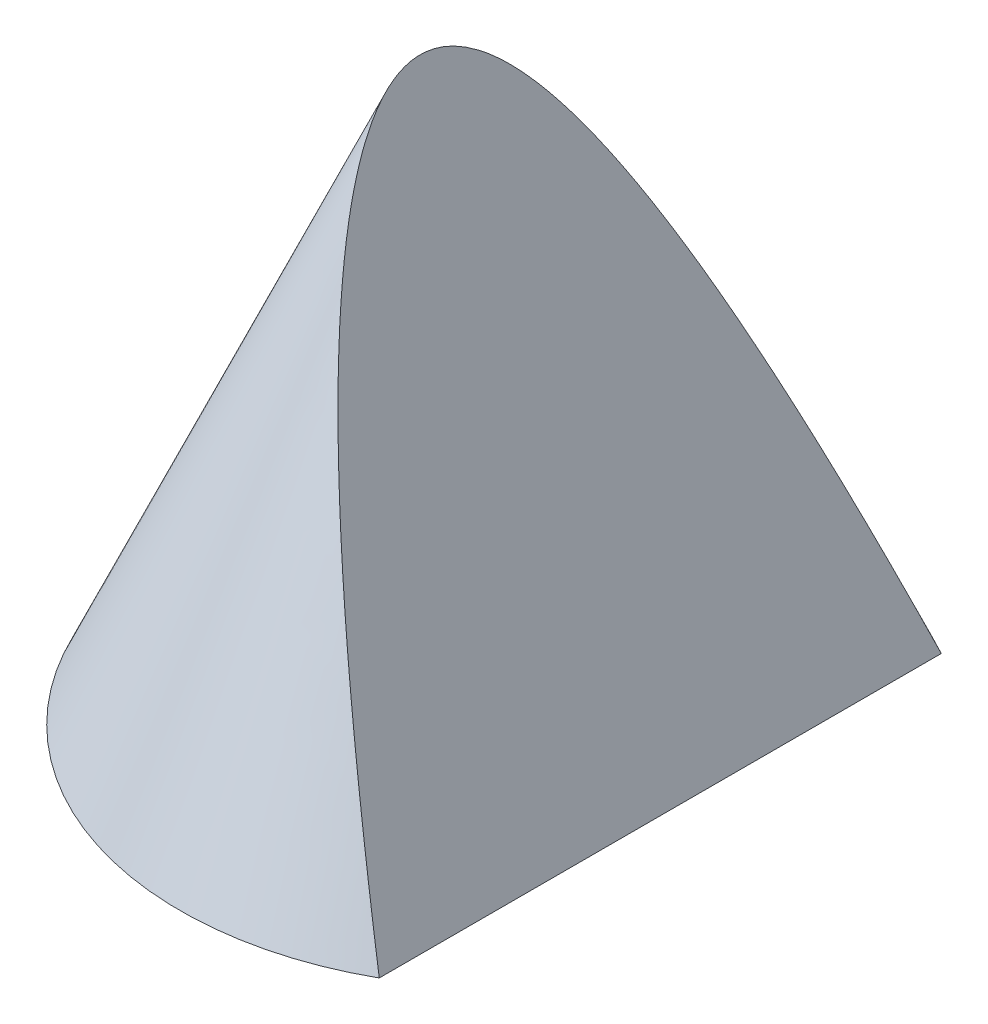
ISO-10303-21;
HEADER;
FILE_DESCRIPTION(('STEP AP214'),'2;1');
FILE_NAME('part.step','',(''),(''),'','','');
FILE_SCHEMA(('AUTOMOTIVE_DESIGN { 1 0 10303 214 1 1 1 1 }'));
ENDSEC;
DATA;
#1=APPLICATION_CONTEXT('core data for automotive mechanical design processes');
#2=APPLICATION_PROTOCOL_DEFINITION('international standard','automotive_design',2000,#1);
#3=PRODUCT_CONTEXT('',#1,'mechanical');
#4=PRODUCT('Part','Part','',(#3));
#5=PRODUCT_RELATED_PRODUCT_CATEGORY('part','',(#4));
#6=PRODUCT_DEFINITION_FORMATION('','',#4);
#7=PRODUCT_DEFINITION_CONTEXT('part definition',#1,'design');
#8=PRODUCT_DEFINITION('design','',#6,#7);
#9=PRODUCT_DEFINITION_SHAPE('','',#8);
#10=(LENGTH_UNIT() NAMED_UNIT(*) SI_UNIT(.MILLI.,.METRE.));
#11=(NAMED_UNIT(*) PLANE_ANGLE_UNIT() SI_UNIT($,.RADIAN.));
#12=(NAMED_UNIT(*) SI_UNIT($,.STERADIAN.) SOLID_ANGLE_UNIT());
#13=UNCERTAINTY_MEASURE_WITH_UNIT(LENGTH_MEASURE(1.E-05),#10,'distance_accuracy_value','');
#14=(GEOMETRIC_REPRESENTATION_CONTEXT(3) GLOBAL_UNCERTAINTY_ASSIGNED_CONTEXT((#13)) GLOBAL_UNIT_ASSIGNED_CONTEXT((#10,
#11,#12)) REPRESENTATION_CONTEXT('',''));
#15=CARTESIAN_POINT('',(0.,0.,0.));
#16=DIRECTION('',(0.,0.,1.));
#17=DIRECTION('',(1.,0.,0.));
#18=AXIS2_PLACEMENT_3D('',#15,#16,#17);
#19=CARTESIAN_POINT('',(0.,0.,0.));
#20=DIRECTION('',(0.,-1.,0.));
#21=DIRECTION('',(0.,0.,1.));
#22=AXIS2_PLACEMENT_3D('',#19,#20,#21);
#23=CONICAL_SURFACE('',#22,18.4677912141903,0.41887902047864);
#24=CARTESIAN_POINT('',(9.04129462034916,-0.000200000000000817,-16.1033410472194));
#25=CARTESIAN_POINT('',(8.83064351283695,0.47293013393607,-15.9800273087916));
#26=CARTESIAN_POINT('',(8.62012192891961,0.945769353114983,-15.8553787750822));
#27=CARTESIAN_POINT('',(8.19936127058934,1.89081326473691,-15.603217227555));
#28=CARTESIAN_POINT('',(7.98912219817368,2.363017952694,-15.475704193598));
#29=CARTESIAN_POINT('',(7.35880991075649,3.77872252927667,-15.0885427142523));
#30=CARTESIAN_POINT('',(6.93920027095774,4.72118121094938,-14.8243061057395));
#31=CARTESIAN_POINT('',(6.09916897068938,6.60792240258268,-14.2801830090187));
#32=CARTESIAN_POINT('',(5.67875573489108,7.55218599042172,-14.0002177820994));
#33=CARTESIAN_POINT('',(4.83985959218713,9.43637757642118,-13.4235051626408));
#34=CARTESIAN_POINT('',(4.42137654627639,10.3763058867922,-13.1267589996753));
#35=CARTESIAN_POINT('',(3.78383007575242,11.8082587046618,-12.6579563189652));
#36=CARTESIAN_POINT('',(3.56388146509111,12.3022713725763,-12.4931641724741));
#37=CARTESIAN_POINT('',(3.12477592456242,13.2885185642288,-12.157330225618));
#38=CARTESIAN_POINT('',(2.90561898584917,13.780753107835,-11.9862884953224));
#39=CARTESIAN_POINT('',(2.46817559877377,14.7632670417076,-11.6371787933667));
#40=CARTESIAN_POINT('',(2.24988936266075,15.2535459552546,-11.4591092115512));
#41=CARTESIAN_POINT('',(1.81440663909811,16.2316561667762,-11.0950878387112));
#42=CARTESIAN_POINT('',(1.59721014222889,16.7194874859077,-10.9091361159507));
#43=CARTESIAN_POINT('',(1.16465030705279,17.6910327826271,-10.5287211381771));
#44=CARTESIAN_POINT('',(0.949283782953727,18.1747539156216,-10.3342798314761));
#45=CARTESIAN_POINT('',(0.520119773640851,19.1386720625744,-9.93510351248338));
#46=CARTESIAN_POINT('',(0.306322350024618,19.6188689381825,-9.73036809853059));
#47=CARTESIAN_POINT('',(-0.119223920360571,20.5746615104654,-9.30898233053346));
#48=CARTESIAN_POINT('',(-0.330973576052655,21.0502590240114,-9.09233692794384));
#49=CARTESIAN_POINT('',(-0.751969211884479,21.9958307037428,-8.64486283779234));
#50=CARTESIAN_POINT('',(-0.96121547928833,22.4658055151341,-8.41403579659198));
#51=CARTESIAN_POINT('',(-1.27026270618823,23.1599369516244,-8.05764605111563));
#52=CARTESIAN_POINT('',(-1.37131265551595,23.3868988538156,-7.93861581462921));
#53=CARTESIAN_POINT('',(-1.57250727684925,23.8387893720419,-7.69600552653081));
#54=CARTESIAN_POINT('',(-1.67265194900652,24.0637179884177,-7.57242547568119));
#55=CARTESIAN_POINT('',(-1.8719431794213,24.5113334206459,-7.32013471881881));
#56=CARTESIAN_POINT('',(-1.97108911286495,24.7340188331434,-7.19142102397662));
#57=CARTESIAN_POINT('',(-2.1681334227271,25.1765875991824,-6.92832134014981));
#58=CARTESIAN_POINT('',(-2.26603177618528,25.3964709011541,-6.79393524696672));
#59=CARTESIAN_POINT('',(-2.46018014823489,25.8325352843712,-6.51898710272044));
#60=CARTESIAN_POINT('',(-2.55643253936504,26.0487216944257,-6.37843520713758));
#61=CARTESIAN_POINT('',(-2.74712749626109,26.4770295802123,-6.0900938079));
#62=CARTESIAN_POINT('',(-2.84157013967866,26.6891512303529,-5.94230461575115));
#63=CARTESIAN_POINT('',(-3.02813586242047,27.108184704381,-5.63858144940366));
#64=CARTESIAN_POINT('',(-3.12026118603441,27.3151015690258,-5.48265584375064));
#65=CARTESIAN_POINT('',(-3.30174240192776,27.7227150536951,-5.1612062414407));
#66=CARTESIAN_POINT('',(-3.39109772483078,27.9234103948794,-4.99568029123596));
#67=CARTESIAN_POINT('',(-3.56736535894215,28.3193139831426,-4.65128192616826));
#68=CARTESIAN_POINT('',(-3.65423116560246,28.5144177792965,-4.47226465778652));
#69=CARTESIAN_POINT('',(-3.82308973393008,28.8936803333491,-4.10092868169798));
#70=CARTESIAN_POINT('',(-3.90508516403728,29.077845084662,-3.90861738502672));
#71=CARTESIAN_POINT('',(-4.0621126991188,29.4305347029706,-3.50948050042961));
#72=CARTESIAN_POINT('',(-4.13718151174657,29.5991420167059,-3.3027430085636));
#73=CARTESIAN_POINT('',(-4.27836366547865,29.9162423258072,-2.87161026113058));
#74=CARTESIAN_POINT('',(-4.34449052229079,30.06476567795,-2.64724248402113));
#75=CARTESIAN_POINT('',(-4.43113314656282,30.2593681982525,-2.30878670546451));
#76=CARTESIAN_POINT('',(-4.45664062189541,30.3166589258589,-2.20237292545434));
#77=CARTESIAN_POINT('',(-4.50478054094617,30.4247829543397,-1.98566373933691));
#78=CARTESIAN_POINT('',(-4.52741322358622,30.4756167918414,-1.87536865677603));
#79=CARTESIAN_POINT('',(-4.56937492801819,30.5698643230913,-1.65102568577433));
#80=CARTESIAN_POINT('',(-4.58870403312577,30.6132782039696,-1.53697789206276));
#81=CARTESIAN_POINT('',(-4.62360756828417,30.6916728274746,-1.30546652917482));
#82=CARTESIAN_POINT('',(-4.63918288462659,30.7266555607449,-1.18800377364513));
#83=CARTESIAN_POINT('',(-4.66630844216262,30.7875805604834,-0.948822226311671));
#84=CARTESIAN_POINT('',(-4.67781040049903,30.8134143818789,-0.82707004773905));
#85=CARTESIAN_POINT('',(-4.6961599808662,30.8546282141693,-0.581450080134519));
#86=CARTESIAN_POINT('',(-4.70300779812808,30.8700086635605,-0.457582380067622));
#87=CARTESIAN_POINT('',(-4.71179766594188,30.889751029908,-0.208891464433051));
#88=CARTESIAN_POINT('',(-4.71374368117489,30.8941218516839,-0.0840691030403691));
#89=CARTESIAN_POINT('',(-4.71266635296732,30.8917021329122,0.165441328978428));
#90=CARTESIAN_POINT('',(-4.70964331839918,30.8849122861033,0.290129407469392));
#91=CARTESIAN_POINT('',(-4.69935930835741,30.8618140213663,0.524231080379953));
#92=CARTESIAN_POINT('',(-4.69261351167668,30.8466627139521,0.633784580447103));
#93=CARTESIAN_POINT('',(-4.675489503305,30.8082015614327,0.851195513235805));
#94=CARTESIAN_POINT('',(-4.66510994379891,30.7848886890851,0.959052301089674));
#95=CARTESIAN_POINT('',(-4.64097921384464,30.7306901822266,1.17249212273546));
#96=CARTESIAN_POINT('',(-4.62722673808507,30.6998016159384,1.2780742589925));
#97=CARTESIAN_POINT('',(-4.59665920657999,30.6311458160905,1.48653496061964));
#98=CARTESIAN_POINT('',(-4.57984325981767,30.5933765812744,1.5894127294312));
#99=CARTESIAN_POINT('',(-4.53355693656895,30.4894157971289,1.84746472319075));
#100=CARTESIAN_POINT('',(-4.50218440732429,30.418951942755,2.00058583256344));
#101=CARTESIAN_POINT('',(-4.43403998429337,30.2658970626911,2.29938268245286));
#102=CARTESIAN_POINT('',(-4.39726507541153,30.1832992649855,2.4450542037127));
#103=CARTESIAN_POINT('',(-4.31923296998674,30.0080362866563,2.72938356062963));
#104=CARTESIAN_POINT('',(-4.27796569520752,29.9153484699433,2.86802455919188));
#105=CARTESIAN_POINT('',(-4.19185091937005,29.7219315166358,3.13832712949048));
#106=CARTESIAN_POINT('',(-4.14700391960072,29.6212035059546,3.26998967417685));
#107=CARTESIAN_POINT('',(-4.04463293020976,29.3912744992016,3.55394891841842));
#108=CARTESIAN_POINT('',(-3.98642751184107,29.260542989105,3.70475569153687));
#109=CARTESIAN_POINT('',(-3.86661305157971,28.9914353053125,3.99801197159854));
#110=CARTESIAN_POINT('',(-3.80500267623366,28.8530561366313,4.14045815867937));
#111=CARTESIAN_POINT('',(-3.67897534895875,28.569994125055,4.41808308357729));
#112=CARTESIAN_POINT('',(-3.61455431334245,28.4253021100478,4.55325056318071));
#113=CARTESIAN_POINT('',(-3.48351336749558,28.1309793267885,4.81690929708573));
#114=CARTESIAN_POINT('',(-3.41689373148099,27.9813491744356,4.94540137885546));
#115=CARTESIAN_POINT('',(-3.28146462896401,27.6771704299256,5.19715612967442));
#116=CARTESIAN_POINT('',(-3.21264507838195,27.5225991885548,5.32038589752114));
#117=CARTESIAN_POINT('',(-3.07347602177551,27.2100203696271,5.56149958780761));
#118=CARTESIAN_POINT('',(-3.00312648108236,27.052012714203,5.67938338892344));
#119=CARTESIAN_POINT('',(-2.86120559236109,26.7332531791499,5.91024789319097));
#120=CARTESIAN_POINT('',(-2.78963543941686,26.5725039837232,6.02323304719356));
#121=CARTESIAN_POINT('',(-2.64540154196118,26.2485493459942,6.24488421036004));
#122=CARTESIAN_POINT('',(-2.57273781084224,26.085343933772,6.35355027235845));
#123=CARTESIAN_POINT('',(-2.36525776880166,25.6193361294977,6.65630582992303));
#124=CARTESIAN_POINT('',(-2.2293231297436,25.3140219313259,6.84577084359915));
#125=CARTESIAN_POINT('',(-1.9549894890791,24.6978584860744,7.21363676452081));
#126=CARTESIAN_POINT('',(-1.81659010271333,24.3870083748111,7.39203592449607));
#127=CARTESIAN_POINT('',(-1.53776124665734,23.7607485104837,7.73944603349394));
#128=CARTESIAN_POINT('',(-1.39733065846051,23.4453362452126,7.90845154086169));
#129=CARTESIAN_POINT('',(-1.11489340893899,22.8109717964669,8.23822879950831));
#130=CARTESIAN_POINT('',(-0.972886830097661,22.492019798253,8.39900097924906));
#131=CARTESIAN_POINT('',(-0.687228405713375,21.8504204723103,8.71371925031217));
#132=CARTESIAN_POINT('',(-0.543573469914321,21.5277662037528,8.86764834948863));
#133=CARTESIAN_POINT('',(-0.255159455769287,20.8799777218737,9.16911327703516));
#134=CARTESIAN_POINT('',(-0.110400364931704,20.5548434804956,9.31664903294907));
#135=CARTESIAN_POINT('',(0.325187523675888,19.5764970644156,9.75065369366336));
#136=CARTESIAN_POINT('',(0.617420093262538,18.9201319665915,10.0286213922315));
#137=CARTESIAN_POINT('',(1.20522413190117,17.5999024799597,10.5667012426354));
#138=CARTESIAN_POINT('',(1.50080104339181,16.9360258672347,10.82677714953));
#139=CARTESIAN_POINT('',(2.09412745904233,15.6033929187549,11.3315998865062));
#140=CARTESIAN_POINT('',(2.39187710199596,14.9346362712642,11.5763457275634));
#141=CARTESIAN_POINT('',(2.98870741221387,13.5941334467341,12.0525397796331));
#142=CARTESIAN_POINT('',(3.28778591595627,12.9223921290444,12.2840044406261));
#143=CARTESIAN_POINT('',(3.88732234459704,11.575811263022,12.73577088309));
#144=CARTESIAN_POINT('',(4.18778023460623,10.9009717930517,12.9560729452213));
#145=CARTESIAN_POINT('',(4.86691176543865,9.37561740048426,13.4421173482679));
#146=CARTESIAN_POINT('',(5.24591722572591,8.52435719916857,13.7050541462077));
#147=CARTESIAN_POINT('',(6.00549630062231,6.81831466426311,14.2179062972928));
#148=CARTESIAN_POINT('',(6.38607033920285,5.96353137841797,14.4678178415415));
#149=CARTESIAN_POINT('',(7.14525924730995,4.25836517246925,14.9542660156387));
#150=CARTESIAN_POINT('',(7.52386421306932,3.40800449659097,15.1908963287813));
#151=CARTESIAN_POINT('',(8.28194209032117,1.70533370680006,15.654220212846));
#152=CARTESIAN_POINT('',(8.66141466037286,0.85302435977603,15.8809171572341));
#153=CARTESIAN_POINT('',(9.04129462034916,-0.000199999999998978,16.1033410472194));
#154=B_SPLINE_CURVE_WITH_KNOTS('',3,(#24,#25,#26,#27,#28,#29,#30,#31,#32,#33,#34,#35,#36,#37,
#38,#39,#40,#41,#42,#43,#44,#45,#46,#47,#48,#49,#50,#51,#52,#53,#54,#55,#56,#57,#58,#59,#60,#61,
#62,#63,#64,#65,#66,#67,#68,#69,#70,#71,#72,#73,#74,#75,#76,#77,#78,#79,#80,#81,#82,#83,#84,#85,
#86,#87,#88,#89,#90,#91,#92,#93,#94,#95,#96,#97,#98,#99,#100,#101,#102,#103,#104,#105,#106,#107,
#108,#109,#110,#111,#112,#113,#114,#115,#116,#117,#118,#119,#120,#121,#122,#123,#124,#125,#126,
#127,#128,#129,#130,#131,#132,#133,#134,#135,#136,#137,#138,#139,#140,#141,#142,#143,#144,#145,
#146,#147,#148,#149,#150,#151,#152,#153),.UNSPECIFIED.,.F.,.F.,(4,2,2,2,2,2,2,2,2,2,2,2,2,2,2,2,
2,2,2,2,2,2,2,2,2,2,2,2,2,2,2,2,2,2,2,2,2,2,2,2,2,2,2,2,2,2,2,2,2,2,2,2,2,2,2,2,2,2,2,2,2,2,2,2,
4),(0.,1.59714715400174,3.19430554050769,6.38906685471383,9.60156437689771,12.8138268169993,
14.5097446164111,16.2056434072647,17.9019330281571,19.5982079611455,21.2903308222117,
22.9825197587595,24.6740104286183,26.3653051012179,27.1917174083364,28.0181295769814,
28.8450301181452,29.6719458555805,30.4975473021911,31.3231132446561,32.1478461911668,
32.9727475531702,33.8083109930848,34.6434123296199,35.473797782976,36.3029137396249,
36.6732565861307,37.0435686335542,37.4138713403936,37.7840865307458,38.1585536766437,
38.5330051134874,38.907153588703,39.281278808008,39.6133035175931,39.9454515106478,
40.2777282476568,40.6101017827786,41.1236045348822,41.6373949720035,42.1523627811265,
42.6672586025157,43.2905313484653,43.9140499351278,44.5385067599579,45.1628859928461,
45.7907230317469,46.4185743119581,47.0458426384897,47.6731032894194,48.8253539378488,
49.9777860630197,51.1308789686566,52.283911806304,53.4396638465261,54.5954289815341,
56.9062082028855,59.2215385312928,61.5370180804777,63.8495648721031,66.1620534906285,
69.0665576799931,71.9719065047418,74.853176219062,77.733459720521),.UNSPECIFIED.);
#155=CARTESIAN_POINT('',(9.0412055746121,0.,-16.1032889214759));
#156=VERTEX_POINT('',#155);
#157=CARTESIAN_POINT('',(9.04120557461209,0.,16.1032889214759));
#158=VERTEX_POINT('',#157);
#159=EDGE_CURVE('E46',#156,#158,#154,.T.);
#160=ORIENTED_EDGE('',*,*,#159,.F.);
#161=CARTESIAN_POINT('',(0.,0.,0.));
#162=DIRECTION('',(0.,1.,0.));
#163=DIRECTION('',(0.,0.,1.));
#164=AXIS2_PLACEMENT_3D('',#161,#162,#163);
#165=CIRCLE('',#164,18.4677912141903);
#166=EDGE_CURVE('E41',#156,#158,#165,.T.);
#167=ORIENTED_EDGE('',*,*,#166,.T.);
#168=EDGE_LOOP('',(#160,#167));
#169=FACE_BOUND('',#168,.T.);
#170=ADVANCED_FACE('F33',(#169),#23,.T.);
#171=CARTESIAN_POINT('',(0.,0.,0.));
#172=DIRECTION('',(0.,1.,0.));
#173=DIRECTION('',(0.,0.,1.));
#174=AXIS2_PLACEMENT_3D('',#171,#172,#173);
#175=PLANE('',#174);
#176=DIRECTION('',(0.,0.,-1.));
#177=VECTOR('',#176,1.);
#178=CARTESIAN_POINT('',(9.04120557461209,0.,0.));
#179=LINE('',#178,#177);
#180=EDGE_CURVE('E11',#158,#156,#179,.T.);
#181=ORIENTED_EDGE('',*,*,#180,.F.);
#182=ORIENTED_EDGE('',*,*,#166,.F.);
#183=EDGE_LOOP('',(#181,#182));
#184=FACE_BOUND('',#183,.T.);
#185=ADVANCED_FACE('F51',(#184),#175,.F.);
#186=CARTESIAN_POINT('',(-4.71329281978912,30.8931092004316,106.460863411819));
#187=DIRECTION('',(0.913545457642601,0.406736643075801,0.));
#188=DIRECTION('',(-0.406736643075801,0.913545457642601,0.));
#189=AXIS2_PLACEMENT_3D('',#186,#187,#188);
#190=PLANE('',#189);
#191=ORIENTED_EDGE('',*,*,#180,.T.);
#192=ORIENTED_EDGE('',*,*,#159,.T.);
#193=EDGE_LOOP('',(#191,#192));
#194=FACE_BOUND('',#193,.T.);
#195=ADVANCED_FACE('F54',(#194),#190,.T.);
#196=CLOSED_SHELL('',(#170,#185,#195));
#197=MANIFOLD_SOLID_BREP('B2',#196);
#198=ADVANCED_BREP_SHAPE_REPRESENTATION('',(#18,#197),#14);
#199=SHAPE_DEFINITION_REPRESENTATION(#9,#198);
ENDSEC;
END-ISO-10303-21;
